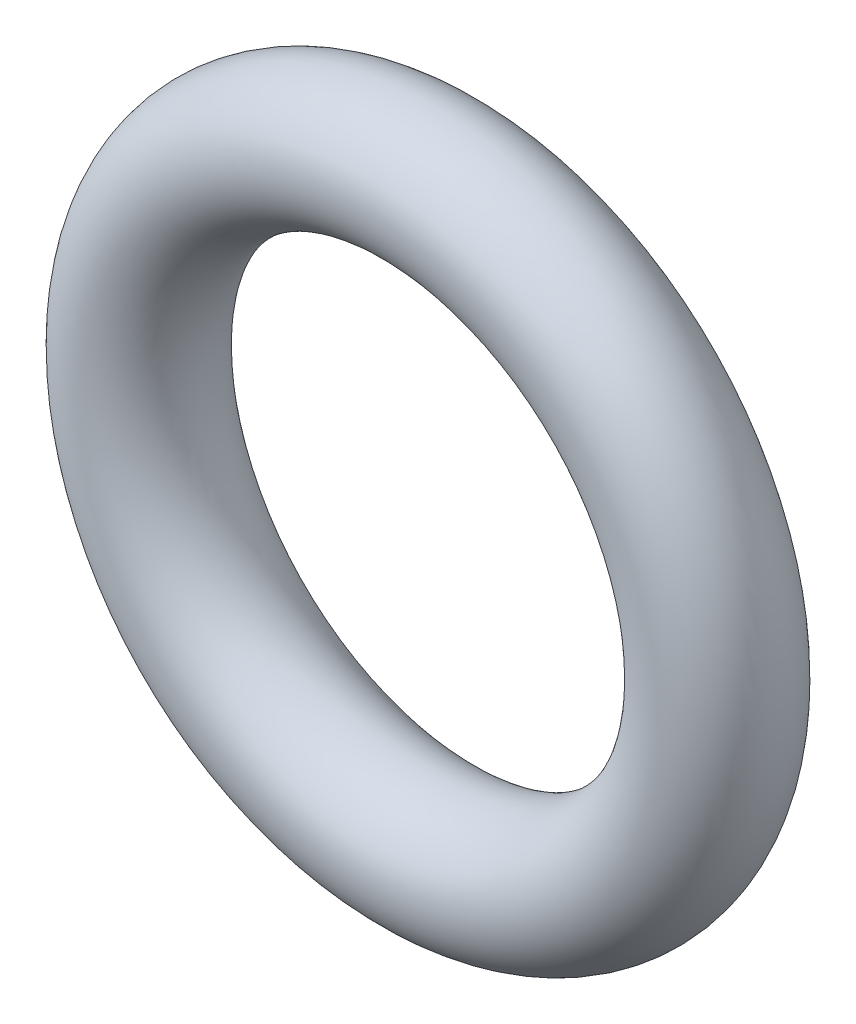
from build123d import *

# Parameters (mm, degrees)
SKETCH1_R = 0.889


with BuildPart() as part:
    # Sketch1 → Revolve1 (revolve)
    with BuildSketch(Plane(origin=(0, 0, 0), x_dir=(0, -1, 0), z_dir=(1, 0, 0)), mode=Mode.PRIVATE) as revolve1_sk:
        with Locations((3.9243, 0)):
            Circle(SKETCH1_R)
    revolve(revolve1_sk.sketch.rotate(Axis((0, 0, 0.889), (0, 0, -1)), 270), axis=Axis((0, 0, 0.889), (0, 0, -1)))


solid = part.part
